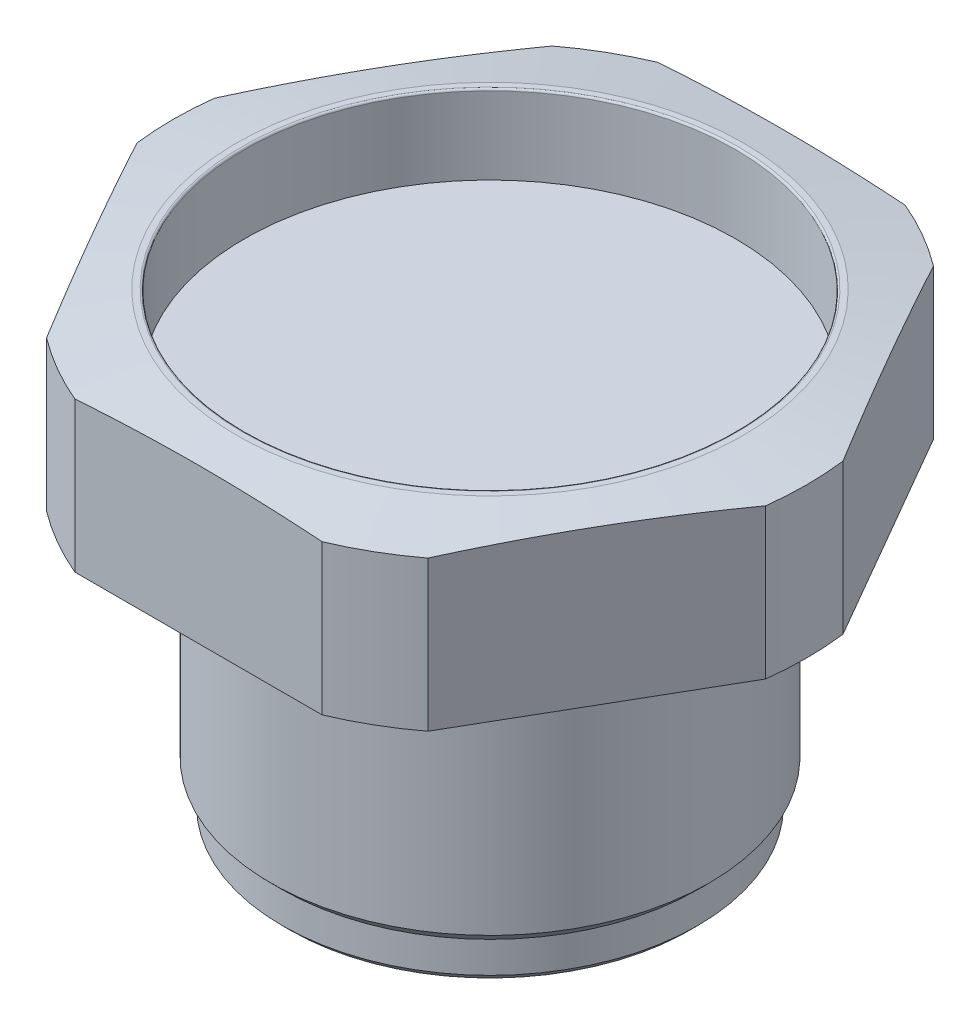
ISO-10303-21;
HEADER;
FILE_DESCRIPTION(('STEP AP214'),'2;1');
FILE_NAME('part.step','',(''),(''),'','','');
FILE_SCHEMA(('AUTOMOTIVE_DESIGN { 1 0 10303 214 1 1 1 1 }'));
ENDSEC;
DATA;
#1=APPLICATION_CONTEXT('core data for automotive mechanical design processes');
#2=APPLICATION_PROTOCOL_DEFINITION('international standard','automotive_design',2000,#1);
#3=PRODUCT_CONTEXT('',#1,'mechanical');
#4=PRODUCT('Part','Part','',(#3));
#5=PRODUCT_RELATED_PRODUCT_CATEGORY('part','',(#4));
#6=PRODUCT_DEFINITION_FORMATION('','',#4);
#7=PRODUCT_DEFINITION_CONTEXT('part definition',#1,'design');
#8=PRODUCT_DEFINITION('design','',#6,#7);
#9=PRODUCT_DEFINITION_SHAPE('','',#8);
#10=(LENGTH_UNIT() NAMED_UNIT(*) SI_UNIT(.MILLI.,.METRE.));
#11=(NAMED_UNIT(*) PLANE_ANGLE_UNIT() SI_UNIT($,.RADIAN.));
#12=(NAMED_UNIT(*) SI_UNIT($,.STERADIAN.) SOLID_ANGLE_UNIT());
#13=UNCERTAINTY_MEASURE_WITH_UNIT(LENGTH_MEASURE(1.E-05),#10,'distance_accuracy_value','');
#14=(GEOMETRIC_REPRESENTATION_CONTEXT(3) GLOBAL_UNCERTAINTY_ASSIGNED_CONTEXT((#13)) GLOBAL_UNIT_ASSIGNED_CONTEXT((#10,
#11,#12)) REPRESENTATION_CONTEXT('',''));
#15=CARTESIAN_POINT('',(0.,0.,0.));
#16=DIRECTION('',(0.,0.,1.));
#17=DIRECTION('',(1.,0.,0.));
#18=AXIS2_PLACEMENT_3D('',#15,#16,#17);
#19=CARTESIAN_POINT('',(27.0499967,-38.354,0.));
#20=DIRECTION('',(0.,-1.,0.));
#21=DIRECTION('',(0.,0.,-1.));
#22=AXIS2_PLACEMENT_3D('',#19,#20,#21);
#23=PLANE('',#22);
#24=CARTESIAN_POINT('',(0.,-38.354,0.));
#25=DIRECTION('',(0.,-1.,0.));
#26=DIRECTION('',(0.,0.,-1.));
#27=AXIS2_PLACEMENT_3D('',#24,#25,#26);
#28=CIRCLE('',#27,23.7209044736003);
#29=CARTESIAN_POINT('',(0.,-38.354,-23.7209044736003));
#30=VERTEX_POINT('',#29);
#31=EDGE_CURVE('E197',#30,#30,#28,.T.);
#32=ORIENTED_EDGE('',*,*,#31,.F.);
#33=EDGE_LOOP('',(#32));
#34=FACE_BOUND('',#33,.T.);
#35=CARTESIAN_POINT('',(0.,-38.354,0.));
#36=DIRECTION('',(0.,-1.,0.));
#37=DIRECTION('',(0.,0.,-1.));
#38=AXIS2_PLACEMENT_3D('',#35,#36,#37);
#39=CIRCLE('',#38,26.0339967);
#40=CARTESIAN_POINT('',(0.,-38.354,-26.0339967));
#41=VERTEX_POINT('',#40);
#42=EDGE_CURVE('E179',#41,#41,#39,.T.);
#43=ORIENTED_EDGE('',*,*,#42,.T.);
#44=EDGE_LOOP('',(#43));
#45=FACE_BOUND('',#44,.T.);
#46=ADVANCED_FACE('F35',(#34,#45),#23,.T.);
#47=CARTESIAN_POINT('',(0.,-8.96894233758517,0.));
#48=DIRECTION('',(0.,-1.,0.));
#49=DIRECTION('',(0.,0.,-1.));
#50=AXIS2_PLACEMENT_3D('',#47,#48,#49);
#51=CYLINDRICAL_SURFACE('',#50,27.0499967);
#52=CARTESIAN_POINT('',(0.,-0.508000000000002,0.));
#53=DIRECTION('',(0.,-1.,0.));
#54=DIRECTION('',(0.,0.,-1.));
#55=AXIS2_PLACEMENT_3D('',#52,#53,#54);
#56=CIRCLE('',#55,27.0499967);
#57=CARTESIAN_POINT('',(0.,-0.508000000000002,-27.0499967));
#58=VERTEX_POINT('',#57);
#59=EDGE_CURVE('E191',#58,#58,#56,.T.);
#60=ORIENTED_EDGE('',*,*,#59,.T.);
#61=EDGE_LOOP('',(#60));
#62=FACE_BOUND('',#61,.T.);
#63=CARTESIAN_POINT('',(0.,-5.08,0.));
#64=DIRECTION('',(0.,-1.,0.));
#65=DIRECTION('',(1.,0.,0.));
#66=AXIS2_PLACEMENT_3D('',#63,#64,#65);
#67=CIRCLE('',#66,27.0499967);
#68=CARTESIAN_POINT('',(27.0499967,-5.08,0.));
#69=VERTEX_POINT('',#68);
#70=EDGE_CURVE('E188',#69,#69,#67,.T.);
#71=ORIENTED_EDGE('',*,*,#70,.F.);
#72=EDGE_LOOP('',(#71));
#73=FACE_BOUND('',#72,.T.);
#74=ADVANCED_FACE('F218',(#62,#73),#51,.T.);
#75=CARTESIAN_POINT('',(0.,19.5502207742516,0.));
#76=DIRECTION('',(0.,-1.,0.));
#77=DIRECTION('',(0.,0.,-1.));
#78=AXIS2_PLACEMENT_3D('',#75,#76,#77);
#79=CONICAL_SURFACE('',#78,41.275,1.39626340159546);
#80=CARTESIAN_POINT('',(0.,21.0058,0.));
#81=DIRECTION('',(0.,-1.,0.));
#82=DIRECTION('',(0.,0.,-1.));
#83=AXIS2_PLACEMENT_3D('',#80,#81,#82);
#84=CIRCLE('',#83,33.02);
#85=CARTESIAN_POINT('',(0.,21.0058,-33.02));
#86=VERTEX_POINT('',#85);
#87=EDGE_CURVE('E393',#86,#86,#84,.T.);
#88=ORIENTED_EDGE('',*,*,#87,.T.);
#89=EDGE_LOOP('',(#88));
#90=FACE_BOUND('',#89,.T.);
#91=CARTESIAN_POINT('',(0.,19.5502207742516,0.));
#92=DIRECTION('',(0.,-1.,0.));
#93=DIRECTION('',(0.,0.,-1.));
#94=AXIS2_PLACEMENT_3D('',#91,#92,#93);
#95=CIRCLE('',#94,41.275);
#96=CARTESIAN_POINT('',(-40.9659173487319,19.5502207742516,5.04174977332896));
#97=VERTEX_POINT('',#96);
#98=CARTESIAN_POINT('',(-40.9659173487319,19.5502207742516,-5.04174977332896));
#99=VERTEX_POINT('',#98);
#100=EDGE_CURVE('E139',#97,#99,#95,.T.);
#101=ORIENTED_EDGE('',*,*,#100,.F.);
#102=CARTESIAN_POINT('',(-40.9673696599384,19.5500207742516,5.0392342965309));
#103=CARTESIAN_POINT('',(-40.6318536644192,19.5962299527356,5.62036504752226));
#104=CARTESIAN_POINT('',(-40.2962544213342,19.640002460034,6.20163998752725));
#105=CARTESIAN_POINT('',(-39.6248953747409,19.7223985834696,7.36446796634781));
#106=CARTESIAN_POINT('',(-39.2891355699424,19.7610221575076,7.94602100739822));
#107=CARTESIAN_POINT('',(-38.2816022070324,19.8687583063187,9.691119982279));
#108=CARTESIAN_POINT('',(-37.609604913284,19.9297320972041,10.8550534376));
#109=CARTESIAN_POINT('',(-36.2660437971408,20.0280404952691,13.182169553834));
#110=CARTESIAN_POINT('',(-35.5944805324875,20.0654054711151,14.3453512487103));
#111=CARTESIAN_POINT('',(-34.251138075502,20.1153717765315,16.6720886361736));
#112=CARTESIAN_POINT('',(-33.5793588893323,20.127973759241,17.8356443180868));
#113=CARTESIAN_POINT('',(-32.2358005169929,20.127973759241,20.1627556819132));
#114=CARTESIAN_POINT('',(-31.5640213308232,20.1153717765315,21.3263113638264));
#115=CARTESIAN_POINT('',(-30.2206788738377,20.0654054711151,23.6530487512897));
#116=CARTESIAN_POINT('',(-29.5491156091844,20.0280404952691,24.816230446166));
#117=CARTESIAN_POINT('',(-28.2055544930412,19.9297320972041,27.1433465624));
#118=CARTESIAN_POINT('',(-27.5335571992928,19.8687583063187,28.307280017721));
#119=CARTESIAN_POINT('',(-26.5260238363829,19.7610221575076,30.0523789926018));
#120=CARTESIAN_POINT('',(-26.1902640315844,19.7223985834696,30.6339320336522));
#121=CARTESIAN_POINT('',(-25.5189049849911,19.640002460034,31.7967600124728));
#122=CARTESIAN_POINT('',(-25.183305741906,19.5962299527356,32.3780349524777));
#123=CARTESIAN_POINT('',(-24.8477897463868,19.5500207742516,32.9591657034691));
#124=B_SPLINE_CURVE_WITH_KNOTS('',3,(#102,#103,#104,#105,#106,#107,#108,#109,#110,#111,#112,
#113,#114,#115,#116,#117,#118,#119,#120,#121,#122,#123),.UNSPECIFIED.,.F.,.F.,(4,2,2,2,2,2,2,2,
2,2,4),(0.,2.01785524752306,4.03572699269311,8.07165217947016,12.1023752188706,16.132991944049,
20.1636086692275,24.1943317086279,28.230256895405,30.248128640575,32.2659838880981),.UNSPECIFIED.);
#125=CARTESIAN_POINT('',(-24.8492420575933,19.5502207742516,32.956650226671));
#126=VERTEX_POINT('',#125);
#127=EDGE_CURVE('E392',#97,#126,#124,.T.);
#128=ORIENTED_EDGE('',*,*,#127,.T.);
#129=CARTESIAN_POINT('',(-16.1166752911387,19.5502207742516,37.9984));
#130=VERTEX_POINT('',#129);
#131=EDGE_CURVE('E384',#130,#126,#95,.T.);
#132=ORIENTED_EDGE('',*,*,#131,.F.);
#133=CARTESIAN_POINT('',(-57.8639051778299,14.6218698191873,37.9984));
#134=CARTESIAN_POINT('',(-57.0019930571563,14.7489031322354,37.9984));
#135=CARTESIAN_POINT('',(-56.139958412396,14.8751046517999,37.9984));
#136=CARTESIAN_POINT('',(-54.4156199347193,15.125664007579,37.9984));
#137=CARTESIAN_POINT('',(-53.5533161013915,15.2500218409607,37.9984));
#138=CARTESIAN_POINT('',(-50.9659374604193,15.6200635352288,37.9984));
#139=CARTESIAN_POINT('',(-49.2404266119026,15.8627109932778,37.9984));
#140=CARTESIAN_POINT('',(-45.7873021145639,16.3382293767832,37.9984));
#141=CARTESIAN_POINT('',(-44.0596878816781,16.5710960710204,37.9984));
#142=CARTESIAN_POINT('',(-40.6028670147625,17.0246892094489,37.9984));
#143=CARTESIAN_POINT('',(-38.8736603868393,17.245415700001,37.9984));
#144=CARTESIAN_POINT('',(-35.419217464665,17.6711956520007,37.9984));
#145=CARTESIAN_POINT('',(-33.6939873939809,17.8762993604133,37.9984));
#146=CARTESIAN_POINT('',(-30.2414345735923,18.2682133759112,37.9984));
#147=CARTESIAN_POINT('',(-28.5141118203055,18.4550236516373,37.9984));
#148=CARTESIAN_POINT('',(-25.0572784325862,18.8062070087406,37.9984));
#149=CARTESIAN_POINT('',(-23.3277679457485,18.9705815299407,37.9984));
#150=CARTESIAN_POINT('',(-19.8663595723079,19.2721663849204,37.9984));
#151=CARTESIAN_POINT('',(-18.1344616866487,19.4093767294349,37.9984));
#152=CARTESIAN_POINT('',(-14.6602163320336,19.6521327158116,37.9984));
#153=CARTESIAN_POINT('',(-12.9178580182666,19.7575264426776,37.9984));
#154=CARTESIAN_POINT('',(-10.3029433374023,19.8876204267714,37.9984));
#155=CARTESIAN_POINT('',(-9.43107075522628,19.9263191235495,37.9984));
#156=CARTESIAN_POINT('',(-7.68694739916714,19.9938955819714,37.9984));
#157=CARTESIAN_POINT('',(-6.81469662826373,20.0227734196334,37.9984));
#158=CARTESIAN_POINT('',(-5.0700654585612,20.0703033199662,37.9984));
#159=CARTESIAN_POINT('',(-4.19768510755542,20.0889571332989,37.9984));
#160=CARTESIAN_POINT('',(-2.45276864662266,20.1157789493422,37.9984));
#161=CARTESIAN_POINT('',(-1.58023253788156,20.1239470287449,37.9984));
#162=CARTESIAN_POINT('',(0.164877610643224,20.1296767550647,37.9984));
#163=CARTESIAN_POINT('',(1.03745165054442,20.1272383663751,37.9984));
#164=CARTESIAN_POINT('',(2.78250560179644,20.1117916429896,37.9984));
#165=CARTESIAN_POINT('',(3.65498551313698,20.0987833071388,37.9984));
#166=CARTESIAN_POINT('',(5.40109406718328,20.0623572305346,37.9984));
#167=CARTESIAN_POINT('',(6.27472237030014,20.0389232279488,37.9984));
#168=CARTESIAN_POINT('',(8.0216525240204,19.9819781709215,37.9984));
#169=CARTESIAN_POINT('',(8.89495437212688,19.9484670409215,37.9984));
#170=CARTESIAN_POINT('',(11.5142177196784,19.833470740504,37.9984));
#171=CARTESIAN_POINT('',(13.2595585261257,19.7375221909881,37.9984));
#172=CARTESIAN_POINT('',(16.748434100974,19.5116068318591,37.9984));
#173=CARTESIAN_POINT('',(18.4919682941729,19.3816313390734,37.9984));
#174=CARTESIAN_POINT('',(21.9766261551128,19.0928384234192,37.9984));
#175=CARTESIAN_POINT('',(23.7177498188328,18.9340209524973,37.9984));
#176=CARTESIAN_POINT('',(27.1033127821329,18.6017526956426,37.9984));
#177=CARTESIAN_POINT('',(28.7478770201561,18.4295617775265,37.9984));
#178=CARTESIAN_POINT('',(32.0350715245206,18.0675285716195,37.9984));
#179=CARTESIAN_POINT('',(33.6777017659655,17.8776860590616,37.9984));
#180=CARTESIAN_POINT('',(36.9612926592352,17.4835029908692,37.9984));
#181=CARTESIAN_POINT('',(38.6022532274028,17.279161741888,37.9984));
#182=CARTESIAN_POINT('',(41.8826385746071,16.8585980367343,37.9984));
#183=CARTESIAN_POINT('',(43.5220633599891,16.6423756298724,37.9984));
#184=CARTESIAN_POINT('',(46.7998380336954,16.2001333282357,37.9984));
#185=CARTESIAN_POINT('',(48.4381877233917,15.974111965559,37.9984));
#186=CARTESIAN_POINT('',(51.7137535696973,15.5140087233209,37.9984));
#187=CARTESIAN_POINT('',(53.3509697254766,15.2799268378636,37.9984));
#188=CARTESIAN_POINT('',(56.624382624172,14.805081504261,37.9984));
#189=CARTESIAN_POINT('',(58.2605793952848,14.5643182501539,37.9984));
#190=CARTESIAN_POINT('',(61.5321396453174,14.0772070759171,37.9984));
#191=CARTESIAN_POINT('',(63.1675031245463,13.8308591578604,37.9984));
#192=CARTESIAN_POINT('',(66.430533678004,13.3345330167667,37.9984));
#193=CARTESIAN_POINT('',(68.0582037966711,13.0845747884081,37.9984));
#194=CARTESIAN_POINT('',(71.3129338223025,12.5807143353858,37.9984));
#195=CARTESIAN_POINT('',(72.9399937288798,12.3268121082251,37.9984));
#196=CARTESIAN_POINT('',(77.8204109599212,11.5600905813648,37.9984));
#197=CARTESIAN_POINT('',(81.07298140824,11.0422601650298,37.9984));
#198=CARTESIAN_POINT('',(85.9496272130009,10.2582808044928,37.9984));
#199=CARTESIAN_POINT('',(87.5742999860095,9.99583189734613,37.9984));
#200=CARTESIAN_POINT('',(90.8232964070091,9.46877892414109,37.9984));
#201=CARTESIAN_POINT('',(92.4476200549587,9.20417485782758,37.9984));
#202=CARTESIAN_POINT('',(95.6959355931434,8.67309809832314,37.9984));
#203=CARTESIAN_POINT('',(97.3199274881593,8.40662543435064,37.9984));
#204=CARTESIAN_POINT('',(100.567638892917,7.87203038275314,37.9984));
#205=CARTESIAN_POINT('',(102.191358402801,7.60390799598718,37.9984));
#206=CARTESIAN_POINT('',(103.814959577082,7.33507210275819,37.9984));
#207=B_SPLINE_CURVE_WITH_KNOTS('',3,(#133,#134,#135,#136,#137,#138,#139,#140,#141,#142,#143,
#144,#145,#146,#147,#148,#149,#150,#151,#152,#153,#154,#155,#156,#157,#158,#159,#160,#161,#162,
#163,#164,#165,#166,#167,#168,#169,#170,#171,#172,#173,#174,#175,#176,#177,#178,#179,#180,#181,
#182,#183,#184,#185,#186,#187,#188,#189,#190,#191,#192,#193,#194,#195,#196,#197,#198,#199,#200,
#201,#202,#203,#204,#205,#206),.UNSPECIFIED.,.F.,.F.,(4,2,2,2,2,2,2,2,2,2,2,2,2,2,2,2,2,2,2,2,2,
2,2,2,2,2,2,2,2,2,2,2,2,2,2,2,4),(0.,2.6136690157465,5.22734204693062,10.454782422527,
15.6844614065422,20.9141204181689,26.1261792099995,31.3382469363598,36.549980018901,
41.7617110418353,46.9979466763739,49.6160934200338,52.2342198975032,54.8518979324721,
57.4695568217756,60.0872244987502,62.7048924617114,65.3266578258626,67.9484428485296,
73.1919483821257,78.4367932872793,83.681646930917,88.6421976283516,93.602811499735,
98.5636627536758,103.524493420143,108.486069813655,113.447649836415,118.409085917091,
123.37052015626,128.310767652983,133.251018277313,143.131593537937,148.068795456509,
153.005997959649,157.943123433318,162.880246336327),.UNSPECIFIED.);
#208=CARTESIAN_POINT('',(16.1166752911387,19.5502207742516,37.9984));
#209=VERTEX_POINT('',#208);
#210=EDGE_CURVE('E287',#130,#209,#207,.T.);
#211=ORIENTED_EDGE('',*,*,#210,.T.);
#212=CARTESIAN_POINT('',(24.8492420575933,19.5502207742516,32.956650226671));
#213=VERTEX_POINT('',#212);
#214=EDGE_CURVE('E356',#213,#209,#95,.T.);
#215=ORIENTED_EDGE('',*,*,#214,.F.);
#216=CARTESIAN_POINT('',(24.8477897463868,19.5500207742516,32.9591657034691));
#217=CARTESIAN_POINT('',(25.183305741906,19.5962299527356,32.3780349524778));
#218=CARTESIAN_POINT('',(25.5189049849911,19.640002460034,31.7967600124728));
#219=CARTESIAN_POINT('',(26.1902640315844,19.7223985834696,30.6339320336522));
#220=CARTESIAN_POINT('',(26.5260238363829,19.7610221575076,30.0523789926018));
#221=CARTESIAN_POINT('',(27.5335571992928,19.8687583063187,28.307280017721));
#222=CARTESIAN_POINT('',(28.2055544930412,19.9297320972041,27.1433465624));
#223=CARTESIAN_POINT('',(29.5491156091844,20.0280404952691,24.8162304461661));
#224=CARTESIAN_POINT('',(30.2206788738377,20.0654054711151,23.6530487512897));
#225=CARTESIAN_POINT('',(31.5640213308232,20.1153717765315,21.3263113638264));
#226=CARTESIAN_POINT('',(32.2358005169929,20.127973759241,20.1627556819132));
#227=CARTESIAN_POINT('',(33.5793588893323,20.127973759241,17.8356443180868));
#228=CARTESIAN_POINT('',(34.251138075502,20.1153717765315,16.6720886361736));
#229=CARTESIAN_POINT('',(35.5944805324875,20.0654054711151,14.3453512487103));
#230=CARTESIAN_POINT('',(36.2660437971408,20.0280404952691,13.182169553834));
#231=CARTESIAN_POINT('',(37.609604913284,19.9297320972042,10.8550534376));
#232=CARTESIAN_POINT('',(38.2816022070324,19.8687583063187,9.69111998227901));
#233=CARTESIAN_POINT('',(39.2891355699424,19.7610221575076,7.94602100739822));
#234=CARTESIAN_POINT('',(39.6248953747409,19.7223985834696,7.36446796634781));
#235=CARTESIAN_POINT('',(40.2962544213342,19.640002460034,6.20163998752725));
#236=CARTESIAN_POINT('',(40.6318536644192,19.5962299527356,5.62036504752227));
#237=CARTESIAN_POINT('',(40.9673696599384,19.5500207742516,5.0392342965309));
#238=B_SPLINE_CURVE_WITH_KNOTS('',3,(#216,#217,#218,#219,#220,#221,#222,#223,#224,#225,#226,
#227,#228,#229,#230,#231,#232,#233,#234,#235,#236,#237),.UNSPECIFIED.,.F.,.F.,(4,2,2,2,2,2,2,2,
2,2,4),(0.,2.01785524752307,4.03572699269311,8.07165217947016,12.1023752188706,16.132991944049,
20.1636086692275,24.1943317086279,28.230256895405,30.248128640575,32.2659838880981),.UNSPECIFIED.);
#239=CARTESIAN_POINT('',(40.9659173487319,19.5502207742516,5.04174977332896));
#240=VERTEX_POINT('',#239);
#241=EDGE_CURVE('E339',#213,#240,#238,.T.);
#242=ORIENTED_EDGE('',*,*,#241,.T.);
#243=CARTESIAN_POINT('',(40.9659173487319,19.5502207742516,-5.04174977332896));
#244=VERTEX_POINT('',#243);
#245=EDGE_CURVE('E162',#244,#240,#95,.T.);
#246=ORIENTED_EDGE('',*,*,#245,.F.);
#247=CARTESIAN_POINT('',(40.9673696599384,19.5500207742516,-5.0392342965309));
#248=CARTESIAN_POINT('',(40.6318536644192,19.5962299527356,-5.62036504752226));
#249=CARTESIAN_POINT('',(40.2962544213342,19.640002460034,-6.20163998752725));
#250=CARTESIAN_POINT('',(39.6248953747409,19.7223985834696,-7.36446796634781));
#251=CARTESIAN_POINT('',(39.2891355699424,19.7610221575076,-7.94602100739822));
#252=CARTESIAN_POINT('',(38.2816022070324,19.8687583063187,-9.691119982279));
#253=CARTESIAN_POINT('',(37.609604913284,19.9297320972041,-10.8550534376));
#254=CARTESIAN_POINT('',(36.2660437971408,20.0280404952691,-13.182169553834));
#255=CARTESIAN_POINT('',(35.5944805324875,20.0654054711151,-14.3453512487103));
#256=CARTESIAN_POINT('',(34.251138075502,20.1153717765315,-16.6720886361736));
#257=CARTESIAN_POINT('',(33.5793588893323,20.127973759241,-17.8356443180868));
#258=CARTESIAN_POINT('',(32.2358005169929,20.127973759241,-20.1627556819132));
#259=CARTESIAN_POINT('',(31.5640213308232,20.1153717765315,-21.3263113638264));
#260=CARTESIAN_POINT('',(30.2206788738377,20.0654054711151,-23.6530487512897));
#261=CARTESIAN_POINT('',(29.5491156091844,20.0280404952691,-24.816230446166));
#262=CARTESIAN_POINT('',(28.2055544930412,19.9297320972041,-27.1433465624));
#263=CARTESIAN_POINT('',(27.5335571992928,19.8687583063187,-28.307280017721));
#264=CARTESIAN_POINT('',(26.5260238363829,19.7610221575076,-30.0523789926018));
#265=CARTESIAN_POINT('',(26.1902640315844,19.7223985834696,-30.6339320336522));
#266=CARTESIAN_POINT('',(25.5189049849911,19.640002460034,-31.7967600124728));
#267=CARTESIAN_POINT('',(25.183305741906,19.5962299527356,-32.3780349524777));
#268=CARTESIAN_POINT('',(24.8477897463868,19.5500207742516,-32.9591657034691));
#269=B_SPLINE_CURVE_WITH_KNOTS('',3,(#247,#248,#249,#250,#251,#252,#253,#254,#255,#256,#257,
#258,#259,#260,#261,#262,#263,#264,#265,#266,#267,#268),.UNSPECIFIED.,.F.,.F.,(4,2,2,2,2,2,2,2,
2,2,4),(0.,2.01785524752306,4.03572699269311,8.07165217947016,12.1023752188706,16.132991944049,
20.1636086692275,24.1943317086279,28.230256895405,30.248128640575,32.2659838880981),.UNSPECIFIED.);
#270=CARTESIAN_POINT('',(24.8492420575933,19.5502207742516,-32.956650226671));
#271=VERTEX_POINT('',#270);
#272=EDGE_CURVE('E331',#244,#271,#269,.T.);
#273=ORIENTED_EDGE('',*,*,#272,.T.);
#274=CARTESIAN_POINT('',(16.1166752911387,19.5502207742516,-37.9984));
#275=VERTEX_POINT('',#274);
#276=EDGE_CURVE('E158',#275,#271,#95,.T.);
#277=ORIENTED_EDGE('',*,*,#276,.F.);
#278=CARTESIAN_POINT('',(-57.8639051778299,14.6218698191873,-37.9984));
#279=CARTESIAN_POINT('',(-57.0019930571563,14.7489031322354,-37.9984));
#280=CARTESIAN_POINT('',(-56.139958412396,14.8751046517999,-37.9984));
#281=CARTESIAN_POINT('',(-54.4156199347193,15.125664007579,-37.9984));
#282=CARTESIAN_POINT('',(-53.5533161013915,15.2500218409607,-37.9984));
#283=CARTESIAN_POINT('',(-50.9659374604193,15.6200635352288,-37.9984));
#284=CARTESIAN_POINT('',(-49.2404266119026,15.8627109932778,-37.9984));
#285=CARTESIAN_POINT('',(-45.7873021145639,16.3382293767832,-37.9984));
#286=CARTESIAN_POINT('',(-44.0596878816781,16.5710960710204,-37.9984));
#287=CARTESIAN_POINT('',(-40.6028670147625,17.0246892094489,-37.9984));
#288=CARTESIAN_POINT('',(-38.8736603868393,17.245415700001,-37.9984));
#289=CARTESIAN_POINT('',(-35.419217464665,17.6711956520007,-37.9984));
#290=CARTESIAN_POINT('',(-33.6939873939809,17.8762993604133,-37.9984));
#291=CARTESIAN_POINT('',(-30.2414345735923,18.2682133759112,-37.9984));
#292=CARTESIAN_POINT('',(-28.5141118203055,18.4550236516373,-37.9984));
#293=CARTESIAN_POINT('',(-25.0572784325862,18.8062070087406,-37.9984));
#294=CARTESIAN_POINT('',(-23.3277679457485,18.9705815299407,-37.9984));
#295=CARTESIAN_POINT('',(-19.8663595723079,19.2721663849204,-37.9984));
#296=CARTESIAN_POINT('',(-18.1344616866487,19.4093767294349,-37.9984));
#297=CARTESIAN_POINT('',(-14.6602163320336,19.6521327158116,-37.9984));
#298=CARTESIAN_POINT('',(-12.9178580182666,19.7575264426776,-37.9984));
#299=CARTESIAN_POINT('',(-10.3029433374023,19.8876204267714,-37.9984));
#300=CARTESIAN_POINT('',(-9.43107075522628,19.9263191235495,-37.9984));
#301=CARTESIAN_POINT('',(-7.68694739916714,19.9938955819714,-37.9984));
#302=CARTESIAN_POINT('',(-6.81469662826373,20.0227734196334,-37.9984));
#303=CARTESIAN_POINT('',(-5.0700654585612,20.0703033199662,-37.9984));
#304=CARTESIAN_POINT('',(-4.19768510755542,20.0889571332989,-37.9984));
#305=CARTESIAN_POINT('',(-2.45276864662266,20.1157789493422,-37.9984));
#306=CARTESIAN_POINT('',(-1.58023253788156,20.1239470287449,-37.9984));
#307=CARTESIAN_POINT('',(0.164877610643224,20.1296767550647,-37.9984));
#308=CARTESIAN_POINT('',(1.03745165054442,20.1272383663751,-37.9984));
#309=CARTESIAN_POINT('',(2.78250560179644,20.1117916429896,-37.9984));
#310=CARTESIAN_POINT('',(3.65498551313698,20.0987833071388,-37.9984));
#311=CARTESIAN_POINT('',(5.40109406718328,20.0623572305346,-37.9984));
#312=CARTESIAN_POINT('',(6.27472237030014,20.0389232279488,-37.9984));
#313=CARTESIAN_POINT('',(8.0216525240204,19.9819781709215,-37.9984));
#314=CARTESIAN_POINT('',(8.89495437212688,19.9484670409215,-37.9984));
#315=CARTESIAN_POINT('',(11.5142177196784,19.833470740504,-37.9984));
#316=CARTESIAN_POINT('',(13.2595585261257,19.7375221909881,-37.9984));
#317=CARTESIAN_POINT('',(16.748434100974,19.5116068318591,-37.9984));
#318=CARTESIAN_POINT('',(18.4919682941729,19.3816313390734,-37.9984));
#319=CARTESIAN_POINT('',(21.9766261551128,19.0928384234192,-37.9984));
#320=CARTESIAN_POINT('',(23.7177498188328,18.9340209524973,-37.9984));
#321=CARTESIAN_POINT('',(27.1033127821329,18.6017526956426,-37.9984));
#322=CARTESIAN_POINT('',(28.7478770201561,18.4295617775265,-37.9984));
#323=CARTESIAN_POINT('',(32.0350715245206,18.0675285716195,-37.9984));
#324=CARTESIAN_POINT('',(33.6777017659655,17.8776860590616,-37.9984));
#325=CARTESIAN_POINT('',(36.9612926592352,17.4835029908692,-37.9984));
#326=CARTESIAN_POINT('',(38.6022532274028,17.279161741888,-37.9984));
#327=CARTESIAN_POINT('',(41.8826385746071,16.8585980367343,-37.9984));
#328=CARTESIAN_POINT('',(43.5220633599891,16.6423756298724,-37.9984));
#329=CARTESIAN_POINT('',(46.7998380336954,16.2001333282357,-37.9984));
#330=CARTESIAN_POINT('',(48.4381877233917,15.974111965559,-37.9984));
#331=CARTESIAN_POINT('',(51.7137535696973,15.5140087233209,-37.9984));
#332=CARTESIAN_POINT('',(53.3509697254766,15.2799268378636,-37.9984));
#333=CARTESIAN_POINT('',(56.624382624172,14.805081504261,-37.9984));
#334=CARTESIAN_POINT('',(58.2605793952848,14.5643182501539,-37.9984));
#335=CARTESIAN_POINT('',(61.5321396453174,14.0772070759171,-37.9984));
#336=CARTESIAN_POINT('',(63.1675031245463,13.8308591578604,-37.9984));
#337=CARTESIAN_POINT('',(66.430533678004,13.3345330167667,-37.9984));
#338=CARTESIAN_POINT('',(68.0582037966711,13.0845747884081,-37.9984));
#339=CARTESIAN_POINT('',(71.3129338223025,12.5807143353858,-37.9984));
#340=CARTESIAN_POINT('',(72.9399937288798,12.3268121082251,-37.9984));
#341=CARTESIAN_POINT('',(77.8204109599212,11.5600905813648,-37.9984));
#342=CARTESIAN_POINT('',(81.07298140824,11.0422601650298,-37.9984));
#343=CARTESIAN_POINT('',(85.9496272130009,10.2582808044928,-37.9984));
#344=CARTESIAN_POINT('',(87.5742999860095,9.99583189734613,-37.9984));
#345=CARTESIAN_POINT('',(90.8232964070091,9.46877892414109,-37.9984));
#346=CARTESIAN_POINT('',(92.4476200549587,9.20417485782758,-37.9984));
#347=CARTESIAN_POINT('',(95.6959355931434,8.67309809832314,-37.9984));
#348=CARTESIAN_POINT('',(97.3199274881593,8.40662543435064,-37.9984));
#349=CARTESIAN_POINT('',(100.567638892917,7.87203038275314,-37.9984));
#350=CARTESIAN_POINT('',(102.191358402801,7.60390799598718,-37.9984));
#351=CARTESIAN_POINT('',(103.814959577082,7.33507210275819,-37.9984));
#352=B_SPLINE_CURVE_WITH_KNOTS('',3,(#278,#279,#280,#281,#282,#283,#284,#285,#286,#287,#288,
#289,#290,#291,#292,#293,#294,#295,#296,#297,#298,#299,#300,#301,#302,#303,#304,#305,#306,#307,
#308,#309,#310,#311,#312,#313,#314,#315,#316,#317,#318,#319,#320,#321,#322,#323,#324,#325,#326,
#327,#328,#329,#330,#331,#332,#333,#334,#335,#336,#337,#338,#339,#340,#341,#342,#343,#344,#345,
#346,#347,#348,#349,#350,#351),.UNSPECIFIED.,.F.,.F.,(4,2,2,2,2,2,2,2,2,2,2,2,2,2,2,2,2,2,2,2,2,
2,2,2,2,2,2,2,2,2,2,2,2,2,2,2,4),(0.,2.6136690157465,5.22734204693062,10.454782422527,
15.6844614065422,20.9141204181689,26.1261792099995,31.3382469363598,36.549980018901,
41.7617110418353,46.9979466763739,49.6160934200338,52.2342198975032,54.8518979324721,
57.4695568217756,60.0872244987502,62.7048924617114,65.3266578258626,67.9484428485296,
73.1919483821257,78.4367932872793,83.681646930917,88.6421976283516,93.602811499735,
98.5636627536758,103.524493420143,108.486069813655,113.447649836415,118.409085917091,
123.37052015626,128.310767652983,133.251018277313,143.131593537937,148.068795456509,
153.005997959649,157.943123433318,162.880246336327),.UNSPECIFIED.);
#353=CARTESIAN_POINT('',(-16.1166752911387,19.5502207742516,-37.9984));
#354=VERTEX_POINT('',#353);
#355=EDGE_CURVE('E321',#275,#354,#352,.F.);
#356=ORIENTED_EDGE('',*,*,#355,.T.);
#357=CARTESIAN_POINT('',(-24.8492420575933,19.5502207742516,-32.956650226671));
#358=VERTEX_POINT('',#357);
#359=EDGE_CURVE('E155',#358,#354,#95,.T.);
#360=ORIENTED_EDGE('',*,*,#359,.F.);
#361=CARTESIAN_POINT('',(-24.8477897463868,19.5500207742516,-32.9591657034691));
#362=CARTESIAN_POINT('',(-25.183305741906,19.5962299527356,-32.3780349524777));
#363=CARTESIAN_POINT('',(-25.5189049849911,19.640002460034,-31.7967600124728));
#364=CARTESIAN_POINT('',(-26.1902640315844,19.7223985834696,-30.6339320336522));
#365=CARTESIAN_POINT('',(-26.5260238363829,19.7610221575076,-30.0523789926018));
#366=CARTESIAN_POINT('',(-27.5335571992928,19.8687583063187,-28.307280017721));
#367=CARTESIAN_POINT('',(-28.2055544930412,19.9297320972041,-27.1433465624));
#368=CARTESIAN_POINT('',(-29.5491156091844,20.0280404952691,-24.816230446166));
#369=CARTESIAN_POINT('',(-30.2206788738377,20.0654054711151,-23.6530487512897));
#370=CARTESIAN_POINT('',(-31.5640213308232,20.1153717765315,-21.3263113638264));
#371=CARTESIAN_POINT('',(-32.2358005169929,20.127973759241,-20.1627556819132));
#372=CARTESIAN_POINT('',(-33.5793588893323,20.127973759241,-17.8356443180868));
#373=CARTESIAN_POINT('',(-34.251138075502,20.1153717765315,-16.6720886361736));
#374=CARTESIAN_POINT('',(-35.5944805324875,20.0654054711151,-14.3453512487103));
#375=CARTESIAN_POINT('',(-36.2660437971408,20.0280404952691,-13.182169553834));
#376=CARTESIAN_POINT('',(-37.609604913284,19.9297320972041,-10.8550534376));
#377=CARTESIAN_POINT('',(-38.2816022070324,19.8687583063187,-9.69111998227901));
#378=CARTESIAN_POINT('',(-39.2891355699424,19.7610221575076,-7.94602100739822));
#379=CARTESIAN_POINT('',(-39.6248953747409,19.7223985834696,-7.36446796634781));
#380=CARTESIAN_POINT('',(-40.2962544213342,19.640002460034,-6.20163998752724));
#381=CARTESIAN_POINT('',(-40.6318536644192,19.5962299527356,-5.62036504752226));
#382=CARTESIAN_POINT('',(-40.9673696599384,19.5500207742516,-5.03923429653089));
#383=B_SPLINE_CURVE_WITH_KNOTS('',3,(#361,#362,#363,#364,#365,#366,#367,#368,#369,#370,#371,
#372,#373,#374,#375,#376,#377,#378,#379,#380,#381,#382),.UNSPECIFIED.,.F.,.F.,(4,2,2,2,2,2,2,2,
2,2,4),(0.,2.01785524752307,4.03572699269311,8.07165217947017,12.1023752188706,16.132991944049,
20.1636086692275,24.1943317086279,28.230256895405,30.248128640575,32.2659838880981),.UNSPECIFIED.);
#384=EDGE_CURVE('E140',#358,#99,#383,.T.);
#385=ORIENTED_EDGE('',*,*,#384,.T.);
#386=EDGE_LOOP('',(#101,#128,#132,#211,#215,#242,#246,#273,#277,#356,#360,#385));
#387=FACE_BOUND('',#386,.T.);
#388=ADVANCED_FACE('F225',(#90,#387),#79,.T.);
#389=CARTESIAN_POINT('',(0.,-8.96894233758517,0.));
#390=DIRECTION('',(0.,-1.,0.));
#391=DIRECTION('',(0.,0.,-1.));
#392=AXIS2_PLACEMENT_3D('',#389,#390,#391);
#393=CYLINDRICAL_SURFACE('',#392,41.275);
#394=CARTESIAN_POINT('',(0.,0.,0.));
#395=DIRECTION('',(0.,-1.,0.));
#396=DIRECTION('',(0.,0.,-1.));
#397=AXIS2_PLACEMENT_3D('',#394,#395,#396);
#398=CIRCLE('',#397,41.275);
#399=CARTESIAN_POINT('',(-40.9659173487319,0.,5.04174977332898));
#400=VERTEX_POINT('',#399);
#401=CARTESIAN_POINT('',(-40.9659173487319,0.,-5.04174977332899));
#402=VERTEX_POINT('',#401);
#403=EDGE_CURVE('E137',#400,#402,#398,.T.);
#404=ORIENTED_EDGE('',*,*,#403,.F.);
#405=DIRECTION('',(0.,-1.,0.));
#406=VECTOR('',#405,1.);
#407=CARTESIAN_POINT('',(-40.9659173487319,-8.96894233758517,5.04174977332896));
#408=LINE('',#407,#406);
#409=EDGE_CURVE('E58',#400,#97,#408,.F.);
#410=ORIENTED_EDGE('',*,*,#409,.T.);
#411=ORIENTED_EDGE('',*,*,#100,.T.);
#412=DIRECTION('',(0.,-1.,0.));
#413=VECTOR('',#412,1.);
#414=CARTESIAN_POINT('',(-40.9659173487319,-8.96894233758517,-5.04174977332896));
#415=LINE('',#414,#413);
#416=EDGE_CURVE('E124',#99,#402,#415,.T.);
#417=ORIENTED_EDGE('',*,*,#416,.T.);
#418=EDGE_LOOP('',(#404,#410,#411,#417));
#419=FACE_BOUND('',#418,.T.);
#420=ADVANCED_FACE('F136',(#419),#393,.T.);
#421=ORIENTED_EDGE('',*,*,#131,.T.);
#422=DIRECTION('',(0.,-1.,0.));
#423=VECTOR('',#422,1.);
#424=CARTESIAN_POINT('',(-24.8492420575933,-8.96894233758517,32.956650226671));
#425=LINE('',#424,#423);
#426=CARTESIAN_POINT('',(-24.8492420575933,0.,32.956650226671));
#427=VERTEX_POINT('',#426);
#428=EDGE_CURVE('E391',#126,#427,#425,.T.);
#429=ORIENTED_EDGE('',*,*,#428,.T.);
#430=CARTESIAN_POINT('',(-16.1166752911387,0.,37.9984));
#431=VERTEX_POINT('',#430);
#432=EDGE_CURVE('E146',#431,#427,#398,.T.);
#433=ORIENTED_EDGE('',*,*,#432,.F.);
#434=DIRECTION('',(0.,-1.,0.));
#435=VECTOR('',#434,1.);
#436=CARTESIAN_POINT('',(-16.1166752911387,-8.96894233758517,37.9984));
#437=LINE('',#436,#435);
#438=EDGE_CURVE('E296',#431,#130,#437,.F.);
#439=ORIENTED_EDGE('',*,*,#438,.T.);
#440=EDGE_LOOP('',(#421,#429,#433,#439));
#441=FACE_BOUND('',#440,.T.);
#442=ADVANCED_FACE('F390',(#441),#393,.T.);
#443=ORIENTED_EDGE('',*,*,#214,.T.);
#444=DIRECTION('',(0.,-1.,0.));
#445=VECTOR('',#444,1.);
#446=CARTESIAN_POINT('',(16.1166752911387,-8.96894233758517,37.9984));
#447=LINE('',#446,#445);
#448=CARTESIAN_POINT('',(16.1166752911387,0.,37.9984));
#449=VERTEX_POINT('',#448);
#450=EDGE_CURVE('E297',#209,#449,#447,.T.);
#451=ORIENTED_EDGE('',*,*,#450,.T.);
#452=CARTESIAN_POINT('',(24.8492420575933,0.,32.956650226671));
#453=VERTEX_POINT('',#452);
#454=EDGE_CURVE('E149',#453,#449,#398,.T.);
#455=ORIENTED_EDGE('',*,*,#454,.F.);
#456=DIRECTION('',(0.,-1.,0.));
#457=VECTOR('',#456,1.);
#458=CARTESIAN_POINT('',(24.8492420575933,-8.96894233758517,32.956650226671));
#459=LINE('',#458,#457);
#460=EDGE_CURVE('E346',#453,#213,#459,.F.);
#461=ORIENTED_EDGE('',*,*,#460,.T.);
#462=EDGE_LOOP('',(#443,#451,#455,#461));
#463=FACE_BOUND('',#462,.T.);
#464=ADVANCED_FACE('F355',(#463),#393,.T.);
#465=ORIENTED_EDGE('',*,*,#245,.T.);
#466=DIRECTION('',(0.,-1.,0.));
#467=VECTOR('',#466,1.);
#468=CARTESIAN_POINT('',(40.9659173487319,-8.96894233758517,5.04174977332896));
#469=LINE('',#468,#467);
#470=CARTESIAN_POINT('',(40.9659173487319,0.,5.04174977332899));
#471=VERTEX_POINT('',#470);
#472=EDGE_CURVE('E347',#240,#471,#469,.T.);
#473=ORIENTED_EDGE('',*,*,#472,.T.);
#474=CARTESIAN_POINT('',(40.9659173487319,0.,-5.041749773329));
#475=VERTEX_POINT('',#474);
#476=EDGE_CURVE('E156',#475,#471,#398,.T.);
#477=ORIENTED_EDGE('',*,*,#476,.F.);
#478=DIRECTION('',(0.,-1.,0.));
#479=VECTOR('',#478,1.);
#480=CARTESIAN_POINT('',(40.9659173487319,-8.96894233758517,-5.04174977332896));
#481=LINE('',#480,#479);
#482=EDGE_CURVE('E365',#475,#244,#481,.F.);
#483=ORIENTED_EDGE('',*,*,#482,.T.);
#484=EDGE_LOOP('',(#465,#473,#477,#483));
#485=FACE_BOUND('',#484,.T.);
#486=ADVANCED_FACE('F364',(#485),#393,.T.);
#487=ORIENTED_EDGE('',*,*,#276,.T.);
#488=DIRECTION('',(0.,-1.,0.));
#489=VECTOR('',#488,1.);
#490=CARTESIAN_POINT('',(24.8492420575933,-8.96894233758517,-32.956650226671));
#491=LINE('',#490,#489);
#492=CARTESIAN_POINT('',(24.8492420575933,0.,-32.956650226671));
#493=VERTEX_POINT('',#492);
#494=EDGE_CURVE('E369',#271,#493,#491,.T.);
#495=ORIENTED_EDGE('',*,*,#494,.T.);
#496=CARTESIAN_POINT('',(16.1166752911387,0.,-37.9984));
#497=VERTEX_POINT('',#496);
#498=EDGE_CURVE('E151',#497,#493,#398,.T.);
#499=ORIENTED_EDGE('',*,*,#498,.F.);
#500=DIRECTION('',(0.,-1.,0.));
#501=VECTOR('',#500,1.);
#502=CARTESIAN_POINT('',(16.1166752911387,-8.96894233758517,-37.9984));
#503=LINE('',#502,#501);
#504=EDGE_CURVE('E373',#497,#275,#503,.F.);
#505=ORIENTED_EDGE('',*,*,#504,.T.);
#506=EDGE_LOOP('',(#487,#495,#499,#505));
#507=FACE_BOUND('',#506,.T.);
#508=ADVANCED_FACE('F428',(#507),#393,.T.);
#509=ORIENTED_EDGE('',*,*,#359,.T.);
#510=DIRECTION('',(0.,-1.,0.));
#511=VECTOR('',#510,1.);
#512=CARTESIAN_POINT('',(-16.1166752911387,-8.96894233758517,-37.9984));
#513=LINE('',#512,#511);
#514=CARTESIAN_POINT('',(-16.1166752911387,0.,-37.9984));
#515=VERTEX_POINT('',#514);
#516=EDGE_CURVE('E378',#354,#515,#513,.T.);
#517=ORIENTED_EDGE('',*,*,#516,.T.);
#518=CARTESIAN_POINT('',(-24.8492420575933,0.,-32.956650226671));
#519=VERTEX_POINT('',#518);
#520=EDGE_CURVE('E147',#519,#515,#398,.T.);
#521=ORIENTED_EDGE('',*,*,#520,.F.);
#522=DIRECTION('',(0.,-1.,0.));
#523=VECTOR('',#522,1.);
#524=CARTESIAN_POINT('',(-24.8492420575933,-8.96894233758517,-32.956650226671));
#525=LINE('',#524,#523);
#526=EDGE_CURVE('E50',#519,#358,#525,.F.);
#527=ORIENTED_EDGE('',*,*,#526,.T.);
#528=EDGE_LOOP('',(#509,#517,#521,#527));
#529=FACE_BOUND('',#528,.T.);
#530=ADVANCED_FACE('F417',(#529),#393,.T.);
#531=CARTESIAN_POINT('',(41.275,0.,0.));
#532=DIRECTION('',(0.,-1.,0.));
#533=DIRECTION('',(0.,0.,-1.));
#534=AXIS2_PLACEMENT_3D('',#531,#532,#533);
#535=PLANE('',#534);
#536=CARTESIAN_POINT('',(0.,0.,0.));
#537=DIRECTION('',(0.,-1.,0.));
#538=DIRECTION('',(0.,0.,-1.));
#539=AXIS2_PLACEMENT_3D('',#536,#537,#538);
#540=CIRCLE('',#539,27.5579967);
#541=CARTESIAN_POINT('',(0.,0.,-27.5579967));
#542=VERTEX_POINT('',#541);
#543=EDGE_CURVE('E194',#542,#542,#540,.F.);
#544=ORIENTED_EDGE('',*,*,#543,.T.);
#545=EDGE_LOOP('',(#544));
#546=FACE_BOUND('',#545,.T.);
#547=ORIENTED_EDGE('',*,*,#432,.T.);
#548=DIRECTION('',(-0.5,0.,-0.866025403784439));
#549=VECTOR('',#548,1.);
#550=CARTESIAN_POINT('',(-22.5888297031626,0.,36.8717992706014));
#551=LINE('',#550,#549);
#552=EDGE_CURVE('E145',#427,#400,#551,.T.);
#553=ORIENTED_EDGE('',*,*,#552,.T.);
#554=ORIENTED_EDGE('',*,*,#403,.T.);
#555=DIRECTION('',(0.5,0.,-0.866025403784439));
#556=VECTOR('',#555,1.);
#557=CARTESIAN_POINT('',(-22.5888297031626,0.,-36.8717992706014));
#558=LINE('',#557,#556);
#559=EDGE_CURVE('E121',#402,#519,#558,.T.);
#560=ORIENTED_EDGE('',*,*,#559,.T.);
#561=ORIENTED_EDGE('',*,*,#520,.T.);
#562=DIRECTION('',(1.,0.,0.));
#563=VECTOR('',#562,1.);
#564=CARTESIAN_POINT('',(41.275,0.,-37.9984));
#565=LINE('',#564,#563);
#566=EDGE_CURVE('E130',#515,#497,#565,.T.);
#567=ORIENTED_EDGE('',*,*,#566,.T.);
#568=ORIENTED_EDGE('',*,*,#498,.T.);
#569=DIRECTION('',(0.5,0.,0.866025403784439));
#570=VECTOR('',#569,1.);
#571=CARTESIAN_POINT('',(43.2263297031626,0.,-1.12660072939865));
#572=LINE('',#571,#570);
#573=EDGE_CURVE('E169',#493,#475,#572,.T.);
#574=ORIENTED_EDGE('',*,*,#573,.T.);
#575=ORIENTED_EDGE('',*,*,#476,.T.);
#576=DIRECTION('',(-0.5,0.,0.866025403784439));
#577=VECTOR('',#576,1.);
#578=CARTESIAN_POINT('',(43.2263297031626,0.,1.12660072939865));
#579=LINE('',#578,#577);
#580=EDGE_CURVE('E172',#471,#453,#579,.T.);
#581=ORIENTED_EDGE('',*,*,#580,.T.);
#582=ORIENTED_EDGE('',*,*,#454,.T.);
#583=DIRECTION('',(-1.,0.,0.));
#584=VECTOR('',#583,1.);
#585=CARTESIAN_POINT('',(41.275,0.,37.9984));
#586=LINE('',#585,#584);
#587=EDGE_CURVE('E175',#449,#431,#586,.T.);
#588=ORIENTED_EDGE('',*,*,#587,.T.);
#589=EDGE_LOOP('',(#547,#553,#554,#560,#561,#567,#568,#574,#575,#581,#582,#588));
#590=FACE_BOUND('',#589,.T.);
#591=ADVANCED_FACE('F144',(#546,#590),#535,.T.);
#592=CARTESIAN_POINT('',(32.004,10.69594,0.));
#593=DIRECTION('',(0.,1.,0.));
#594=DIRECTION('',(0.,0.,1.));
#595=AXIS2_PLACEMENT_3D('',#592,#593,#594);
#596=PLANE('',#595);
#597=CARTESIAN_POINT('',(0.,10.69594,0.));
#598=DIRECTION('',(0.,-1.,0.));
#599=DIRECTION('',(0.,0.,-1.));
#600=AXIS2_PLACEMENT_3D('',#597,#598,#599);
#601=CIRCLE('',#600,32.004);
#602=CARTESIAN_POINT('',(0.,10.69594,-32.004));
#603=VERTEX_POINT('',#602);
#604=EDGE_CURVE('E150',#603,#603,#601,.T.);
#605=ORIENTED_EDGE('',*,*,#604,.F.);
#606=EDGE_LOOP('',(#605));
#607=FACE_BOUND('',#606,.T.);
#608=ADVANCED_FACE('F410',(#607),#596,.T.);
#609=CARTESIAN_POINT('',(0.,-8.96894233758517,0.));
#610=DIRECTION('',(0.,-1.,0.));
#611=DIRECTION('',(0.,0.,-1.));
#612=AXIS2_PLACEMENT_3D('',#609,#610,#611);
#613=CYLINDRICAL_SURFACE('',#612,32.004);
#614=CARTESIAN_POINT('',(0.,20.7558,0.));
#615=DIRECTION('',(0.,1.,0.));
#616=DIRECTION('',(0.,0.,1.));
#617=AXIS2_PLACEMENT_3D('',#614,#615,#616);
#618=CIRCLE('',#617,32.004);
#619=CARTESIAN_POINT('',(0.,20.7558,32.004));
#620=VERTEX_POINT('',#619);
#621=EDGE_CURVE('E131',#620,#620,#618,.T.);
#622=ORIENTED_EDGE('',*,*,#621,.T.);
#623=EDGE_LOOP('',(#622));
#624=FACE_BOUND('',#623,.T.);
#625=ORIENTED_EDGE('',*,*,#604,.T.);
#626=EDGE_LOOP('',(#625));
#627=FACE_BOUND('',#626,.T.);
#628=ADVANCED_FACE('F407',(#624,#627),#613,.F.);
#629=CARTESIAN_POINT('',(32.004,21.0058,0.));
#630=DIRECTION('',(0.,1.,0.));
#631=DIRECTION('',(0.,0.,1.));
#632=AXIS2_PLACEMENT_3D('',#629,#630,#631);
#633=PLANE('',#632);
#634=CARTESIAN_POINT('',(0.,21.0058,0.));
#635=DIRECTION('',(0.,1.,0.));
#636=DIRECTION('',(0.,0.,1.));
#637=AXIS2_PLACEMENT_3D('',#634,#635,#636);
#638=CIRCLE('',#637,32.254);
#639=CARTESIAN_POINT('',(0.,21.0058,32.254));
#640=VERTEX_POINT('',#639);
#641=EDGE_CURVE('E161',#640,#640,#638,.F.);
#642=ORIENTED_EDGE('',*,*,#641,.T.);
#643=EDGE_LOOP('',(#642));
#644=FACE_BOUND('',#643,.T.);
#645=ORIENTED_EDGE('',*,*,#87,.F.);
#646=EDGE_LOOP('',(#645));
#647=FACE_BOUND('',#646,.T.);
#648=ADVANCED_FACE('F404',(#644,#647),#633,.T.);
#649=CARTESIAN_POINT('',(0.,20.7558,0.));
#650=DIRECTION('',(0.,1.,0.));
#651=DIRECTION('',(0.,0.,1.));
#652=AXIS2_PLACEMENT_3D('',#649,#650,#651);
#653=TOROIDAL_SURFACE('',#652,32.254,0.25);
#654=ORIENTED_EDGE('',*,*,#621,.F.);
#655=EDGE_LOOP('',(#654));
#656=FACE_BOUND('',#655,.T.);
#657=ORIENTED_EDGE('',*,*,#641,.F.);
#658=EDGE_LOOP('',(#657));
#659=FACE_BOUND('',#658,.T.);
#660=ADVANCED_FACE('F306',(#656,#659),#653,.T.);
#661=CARTESIAN_POINT('',(-21.9383864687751,21.0058,-37.9984));
#662=DIRECTION('',(-0.866025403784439,0.,-0.5));
#663=DIRECTION('',(-0.5,0.,0.866025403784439));
#664=AXIS2_PLACEMENT_3D('',#661,#662,#663);
#665=PLANE('',#664);
#666=ORIENTED_EDGE('',*,*,#559,.F.);
#667=ORIENTED_EDGE('',*,*,#416,.F.);
#668=ORIENTED_EDGE('',*,*,#384,.F.);
#669=ORIENTED_EDGE('',*,*,#526,.F.);
#670=EDGE_LOOP('',(#666,#667,#668,#669));
#671=FACE_BOUND('',#670,.T.);
#672=ADVANCED_FACE('F123',(#671),#665,.T.);
#673=CARTESIAN_POINT('',(21.9383864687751,21.0058,-37.9984));
#674=DIRECTION('',(0.,0.,-1.));
#675=DIRECTION('',(-1.,0.,0.));
#676=AXIS2_PLACEMENT_3D('',#673,#674,#675);
#677=PLANE('',#676);
#678=ORIENTED_EDGE('',*,*,#566,.F.);
#679=ORIENTED_EDGE('',*,*,#516,.F.);
#680=ORIENTED_EDGE('',*,*,#355,.F.);
#681=ORIENTED_EDGE('',*,*,#504,.F.);
#682=EDGE_LOOP('',(#678,#679,#680,#681));
#683=FACE_BOUND('',#682,.T.);
#684=ADVANCED_FACE('F621',(#683),#677,.T.);
#685=CARTESIAN_POINT('',(43.8767729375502,21.0058,0.));
#686=DIRECTION('',(0.866025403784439,0.,-0.5));
#687=DIRECTION('',(-0.5,0.,-0.866025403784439));
#688=AXIS2_PLACEMENT_3D('',#685,#686,#687);
#689=PLANE('',#688);
#690=ORIENTED_EDGE('',*,*,#573,.F.);
#691=ORIENTED_EDGE('',*,*,#494,.F.);
#692=ORIENTED_EDGE('',*,*,#272,.F.);
#693=ORIENTED_EDGE('',*,*,#482,.F.);
#694=EDGE_LOOP('',(#690,#691,#692,#693));
#695=FACE_BOUND('',#694,.T.);
#696=ADVANCED_FACE('F613',(#695),#689,.T.);
#697=CARTESIAN_POINT('',(21.9383864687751,21.0058,37.9984));
#698=DIRECTION('',(0.866025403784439,0.,0.5));
#699=DIRECTION('',(0.5,0.,-0.866025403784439));
#700=AXIS2_PLACEMENT_3D('',#697,#698,#699);
#701=PLANE('',#700);
#702=ORIENTED_EDGE('',*,*,#580,.F.);
#703=ORIENTED_EDGE('',*,*,#472,.F.);
#704=ORIENTED_EDGE('',*,*,#241,.F.);
#705=ORIENTED_EDGE('',*,*,#460,.F.);
#706=EDGE_LOOP('',(#702,#703,#704,#705));
#707=FACE_BOUND('',#706,.T.);
#708=ADVANCED_FACE('F282',(#707),#701,.T.);
#709=CARTESIAN_POINT('',(-21.9383864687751,21.0058,37.9984));
#710=DIRECTION('',(0.,0.,1.));
#711=DIRECTION('',(1.,0.,0.));
#712=AXIS2_PLACEMENT_3D('',#709,#710,#711);
#713=PLANE('',#712);
#714=ORIENTED_EDGE('',*,*,#587,.F.);
#715=ORIENTED_EDGE('',*,*,#450,.F.);
#716=ORIENTED_EDGE('',*,*,#210,.F.);
#717=ORIENTED_EDGE('',*,*,#438,.F.);
#718=EDGE_LOOP('',(#714,#715,#716,#717));
#719=FACE_BOUND('',#718,.T.);
#720=ADVANCED_FACE('F278',(#719),#713,.T.);
#721=CARTESIAN_POINT('',(-43.8767729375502,21.0058,0.));
#722=DIRECTION('',(-0.866025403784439,0.,0.5));
#723=DIRECTION('',(0.5,0.,0.866025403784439));
#724=AXIS2_PLACEMENT_3D('',#721,#722,#723);
#725=PLANE('',#724);
#726=ORIENTED_EDGE('',*,*,#552,.F.);
#727=ORIENTED_EDGE('',*,*,#428,.F.);
#728=ORIENTED_EDGE('',*,*,#127,.F.);
#729=ORIENTED_EDGE('',*,*,#409,.F.);
#730=EDGE_LOOP('',(#726,#727,#728,#729));
#731=FACE_BOUND('',#730,.T.);
#732=ADVANCED_FACE('F276',(#731),#725,.T.);
#733=CARTESIAN_POINT('',(0.,-5.08,0.));
#734=DIRECTION('',(0.,-1.,0.));
#735=DIRECTION('',(1.,0.,0.));
#736=AXIS2_PLACEMENT_3D('',#733,#734,#735);
#737=CONICAL_SURFACE('',#736,27.0499967,0.785398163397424);
#738=CARTESIAN_POINT('',(0.,-6.60500330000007,0.));
#739=DIRECTION('',(0.,1.,0.));
#740=DIRECTION('',(-1.,0.,0.));
#741=AXIS2_PLACEMENT_3D('',#738,#739,#740);
#742=CIRCLE('',#741,28.575);
#743=CARTESIAN_POINT('',(-28.575,-6.60500330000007,0.));
#744=VERTEX_POINT('',#743);
#745=EDGE_CURVE('E141',#744,#744,#742,.T.);
#746=ORIENTED_EDGE('',*,*,#745,.T.);
#747=EDGE_LOOP('',(#746));
#748=FACE_BOUND('',#747,.T.);
#749=ORIENTED_EDGE('',*,*,#70,.T.);
#750=EDGE_LOOP('',(#749));
#751=FACE_BOUND('',#750,.T.);
#752=ADVANCED_FACE('F272',(#748,#751),#737,.T.);
#753=CARTESIAN_POINT('',(0.,0.,0.));
#754=DIRECTION('',(0.,1.,0.));
#755=DIRECTION('',(-1.,0.,0.));
#756=AXIS2_PLACEMENT_3D('',#753,#754,#755);
#757=CYLINDRICAL_SURFACE('',#756,28.575);
#758=CARTESIAN_POINT('',(0.,-31.7489967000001,0.));
#759=DIRECTION('',(0.,1.,0.));
#760=DIRECTION('',(-1.,0.,0.));
#761=AXIS2_PLACEMENT_3D('',#758,#759,#760);
#762=CIRCLE('',#761,28.575);
#763=CARTESIAN_POINT('',(-28.575,-31.7489967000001,0.));
#764=VERTEX_POINT('',#763);
#765=EDGE_CURVE('E446',#764,#764,#762,.T.);
#766=ORIENTED_EDGE('',*,*,#765,.T.);
#767=EDGE_LOOP('',(#766));
#768=FACE_BOUND('',#767,.T.);
#769=ORIENTED_EDGE('',*,*,#745,.F.);
#770=EDGE_LOOP('',(#769));
#771=FACE_BOUND('',#770,.T.);
#772=ADVANCED_FACE('F268',(#768,#771),#757,.T.);
#773=CARTESIAN_POINT('',(0.,-31.7489967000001,0.));
#774=DIRECTION('',(0.,1.,0.));
#775=DIRECTION('',(-1.,0.,0.));
#776=AXIS2_PLACEMENT_3D('',#773,#774,#775);
#777=CONICAL_SURFACE('',#776,28.575,0.785398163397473);
#778=CARTESIAN_POINT('',(0.,-33.274,0.));
#779=DIRECTION('',(0.,1.,0.));
#780=DIRECTION('',(-1.,0.,0.));
#781=AXIS2_PLACEMENT_3D('',#778,#779,#780);
#782=CIRCLE('',#781,27.0499967);
#783=CARTESIAN_POINT('',(-27.0499967,-33.274,0.));
#784=VERTEX_POINT('',#783);
#785=EDGE_CURVE('E185',#784,#784,#782,.T.);
#786=ORIENTED_EDGE('',*,*,#785,.T.);
#787=EDGE_LOOP('',(#786));
#788=FACE_BOUND('',#787,.T.);
#789=ORIENTED_EDGE('',*,*,#765,.F.);
#790=EDGE_LOOP('',(#789));
#791=FACE_BOUND('',#790,.T.);
#792=ADVANCED_FACE('F264',(#788,#791),#777,.T.);
#793=CARTESIAN_POINT('',(0.,-38.354,0.));
#794=DIRECTION('',(0.,1.,0.));
#795=DIRECTION('',(0.,0.,1.));
#796=AXIS2_PLACEMENT_3D('',#793,#794,#795);
#797=CONICAL_SURFACE('',#796,26.0339967,0.785398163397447);
#798=CARTESIAN_POINT('',(0.,-37.338,0.));
#799=DIRECTION('',(0.,-1.,0.));
#800=DIRECTION('',(0.,0.,-1.));
#801=AXIS2_PLACEMENT_3D('',#798,#799,#800);
#802=CIRCLE('',#801,27.0499967);
#803=CARTESIAN_POINT('',(0.,-37.338,-27.0499967));
#804=VERTEX_POINT('',#803);
#805=EDGE_CURVE('E182',#804,#804,#802,.F.);
#806=ORIENTED_EDGE('',*,*,#805,.F.);
#807=EDGE_LOOP('',(#806));
#808=FACE_BOUND('',#807,.T.);
#809=ORIENTED_EDGE('',*,*,#42,.F.);
#810=EDGE_LOOP('',(#809));
#811=FACE_BOUND('',#810,.T.);
#812=ADVANCED_FACE('F267',(#808,#811),#797,.T.);
#813=ORIENTED_EDGE('',*,*,#785,.F.);
#814=EDGE_LOOP('',(#813));
#815=FACE_BOUND('',#814,.T.);
#816=ORIENTED_EDGE('',*,*,#805,.T.);
#817=EDGE_LOOP('',(#816));
#818=FACE_BOUND('',#817,.T.);
#819=ADVANCED_FACE('F228',(#815,#818),#51,.T.);
#820=CARTESIAN_POINT('',(0.,-0.508000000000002,0.));
#821=DIRECTION('',(0.,-1.,0.));
#822=DIRECTION('',(0.,0.,-1.));
#823=AXIS2_PLACEMENT_3D('',#820,#821,#822);
#824=TOROIDAL_SURFACE('',#823,27.5579967,0.508);
#825=ORIENTED_EDGE('',*,*,#543,.F.);
#826=EDGE_LOOP('',(#825));
#827=FACE_BOUND('',#826,.T.);
#828=ORIENTED_EDGE('',*,*,#59,.F.);
#829=EDGE_LOOP('',(#828));
#830=FACE_BOUND('',#829,.T.);
#831=ADVANCED_FACE('F262',(#827,#830),#824,.F.);
#832=CARTESIAN_POINT('',(0.,-36.9824,0.));
#833=DIRECTION('',(0.,-1.,0.));
#834=DIRECTION('',(1.,0.,0.));
#835=AXIS2_PLACEMENT_3D('',#832,#833,#834);
#836=PLANE('',#835);
#837=CARTESIAN_POINT('',(0.,-36.9824,0.));
#838=DIRECTION('',(0.,1.,0.));
#839=DIRECTION('',(-1.,0.,0.));
#840=AXIS2_PLACEMENT_3D('',#837,#838,#839);
#841=CIRCLE('',#840,11.2649);
#842=CARTESIAN_POINT('',(-11.2649,-36.9824,0.));
#843=VERTEX_POINT('',#842);
#844=EDGE_CURVE('E447',#843,#843,#841,.T.);
#845=ORIENTED_EDGE('',*,*,#844,.F.);
#846=EDGE_LOOP('',(#845));
#847=FACE_BOUND('',#846,.T.);
#848=ADVANCED_FACE('F258',(#847),#836,.T.);
#849=CARTESIAN_POINT('',(0.,0.,0.));
#850=DIRECTION('',(0.,1.,0.));
#851=DIRECTION('',(-1.,0.,0.));
#852=AXIS2_PLACEMENT_3D('',#849,#850,#851);
#853=CYLINDRICAL_SURFACE('',#852,11.2649);
#854=ORIENTED_EDGE('',*,*,#844,.T.);
#855=EDGE_LOOP('',(#854));
#856=FACE_BOUND('',#855,.T.);
#857=CARTESIAN_POINT('',(0.,-38.354,0.));
#858=DIRECTION('',(0.,1.,0.));
#859=DIRECTION('',(-1.,0.,0.));
#860=AXIS2_PLACEMENT_3D('',#857,#858,#859);
#861=CIRCLE('',#860,11.2649);
#862=CARTESIAN_POINT('',(-11.2649,-38.354,0.));
#863=VERTEX_POINT('',#862);
#864=EDGE_CURVE('E452',#863,#863,#861,.T.);
#865=ORIENTED_EDGE('',*,*,#864,.F.);
#866=EDGE_LOOP('',(#865));
#867=FACE_BOUND('',#866,.T.);
#868=ADVANCED_FACE('F234',(#856,#867),#853,.F.);
#869=ORIENTED_EDGE('',*,*,#864,.T.);
#870=EDGE_LOOP('',(#869));
#871=FACE_BOUND('',#870,.T.);
#872=CARTESIAN_POINT('',(0.,-38.354,0.));
#873=DIRECTION('',(0.,1.,0.));
#874=DIRECTION('',(-1.,0.,0.));
#875=AXIS2_PLACEMENT_3D('',#872,#873,#874);
#876=CIRCLE('',#875,12.573);
#877=CARTESIAN_POINT('',(-12.573,-38.354,0.));
#878=VERTEX_POINT('',#877);
#879=EDGE_CURVE('E457',#878,#878,#876,.T.);
#880=ORIENTED_EDGE('',*,*,#879,.F.);
#881=EDGE_LOOP('',(#880));
#882=FACE_BOUND('',#881,.T.);
#883=ADVANCED_FACE('F221',(#871,#882),#23,.T.);
#884=CARTESIAN_POINT('',(0.,-37.8714,0.));
#885=DIRECTION('',(0.,1.,0.));
#886=DIRECTION('',(-1.,0.,0.));
#887=AXIS2_PLACEMENT_3D('',#884,#885,#886);
#888=TOROIDAL_SURFACE('',#887,13.462,0.889000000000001);
#889=CARTESIAN_POINT('',(0.,-38.389835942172,0.));
#890=DIRECTION('',(0.,1.,0.));
#891=DIRECTION('',(-1.,0.,0.));
#892=AXIS2_PLACEMENT_3D('',#889,#890,#891);
#893=CIRCLE('',#892,12.739819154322);
#894=CARTESIAN_POINT('',(-12.739819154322,-38.389835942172,0.));
#895=VERTEX_POINT('',#894);
#896=EDGE_CURVE('E200',#895,#895,#893,.T.);
#897=ORIENTED_EDGE('',*,*,#896,.T.);
#898=EDGE_LOOP('',(#897));
#899=FACE_BOUND('',#898,.T.);
#900=CARTESIAN_POINT('',(0.,-37.8714,0.));
#901=DIRECTION('',(0.,1.,0.));
#902=DIRECTION('',(-1.,0.,0.));
#903=AXIS2_PLACEMENT_3D('',#900,#901,#902);
#904=CIRCLE('',#903,14.351);
#905=CARTESIAN_POINT('',(-14.351,-37.8714,0.));
#906=VERTEX_POINT('',#905);
#907=EDGE_CURVE('E460',#906,#906,#904,.T.);
#908=ORIENTED_EDGE('',*,*,#907,.F.);
#909=EDGE_LOOP('',(#908));
#910=FACE_BOUND('',#909,.T.);
#911=ADVANCED_FACE('F233',(#899,#910),#888,.T.);
#912=CARTESIAN_POINT('',(0.,0.,0.));
#913=DIRECTION('',(0.,1.,0.));
#914=DIRECTION('',(-1.,0.,0.));
#915=AXIS2_PLACEMENT_3D('',#912,#913,#914);
#916=CYLINDRICAL_SURFACE('',#915,14.351);
#917=CARTESIAN_POINT('',(0.,-38.227,0.));
#918=DIRECTION('',(0.,-1.,0.));
#919=DIRECTION('',(0.,0.,-1.));
#920=AXIS2_PLACEMENT_3D('',#917,#918,#919);
#921=CIRCLE('',#920,14.351);
#922=CARTESIAN_POINT('',(0.,-38.227,-14.351));
#923=VERTEX_POINT('',#922);
#924=EDGE_CURVE('E12',#923,#923,#921,.T.);
#925=ORIENTED_EDGE('',*,*,#924,.T.);
#926=EDGE_LOOP('',(#925));
#927=FACE_BOUND('',#926,.T.);
#928=ORIENTED_EDGE('',*,*,#907,.T.);
#929=EDGE_LOOP('',(#928));
#930=FACE_BOUND('',#929,.T.);
#931=ADVANCED_FACE('F238',(#927,#930),#916,.F.);
#932=CARTESIAN_POINT('',(0.,-38.354,0.));
#933=DIRECTION('',(0.,-1.,0.));
#934=DIRECTION('',(0.,0.,-1.));
#935=AXIS2_PLACEMENT_3D('',#932,#933,#934);
#936=CIRCLE('',#935,14.478);
#937=CARTESIAN_POINT('',(0.,-38.354,-14.478));
#938=VERTEX_POINT('',#937);
#939=EDGE_CURVE('E43',#938,#938,#936,.F.);
#940=ORIENTED_EDGE('',*,*,#939,.T.);
#941=EDGE_LOOP('',(#940));
#942=FACE_BOUND('',#941,.T.);
#943=CARTESIAN_POINT('',(0.,-38.354,0.));
#944=DIRECTION('',(0.,1.,0.));
#945=DIRECTION('',(-1.,0.,0.));
#946=AXIS2_PLACEMENT_3D('',#943,#944,#945);
#947=CIRCLE('',#946,15.875);
#948=CARTESIAN_POINT('',(-15.875,-38.354,0.));
#949=VERTEX_POINT('',#948);
#950=EDGE_CURVE('E463',#949,#949,#947,.T.);
#951=ORIENTED_EDGE('',*,*,#950,.F.);
#952=EDGE_LOOP('',(#951));
#953=FACE_BOUND('',#952,.T.);
#954=ADVANCED_FACE('F205',(#942,#953),#23,.T.);
#955=CARTESIAN_POINT('',(0.,-38.354,0.));
#956=DIRECTION('',(0.,1.,0.));
#957=DIRECTION('',(-1.,0.,0.));
#958=AXIS2_PLACEMENT_3D('',#955,#956,#957);
#959=TOROIDAL_SURFACE('',#958,17.2466,1.3716);
#960=ORIENTED_EDGE('',*,*,#950,.T.);
#961=EDGE_LOOP('',(#960));
#962=FACE_BOUND('',#961,.T.);
#963=CARTESIAN_POINT('',(0.,-36.9824,0.));
#964=DIRECTION('',(0.,1.,0.));
#965=DIRECTION('',(-1.,0.,0.));
#966=AXIS2_PLACEMENT_3D('',#963,#964,#965);
#967=CIRCLE('',#966,17.2466);
#968=CARTESIAN_POINT('',(-17.2466,-36.9824,0.));
#969=VERTEX_POINT('',#968);
#970=EDGE_CURVE('E469',#969,#969,#967,.T.);
#971=ORIENTED_EDGE('',*,*,#970,.F.);
#972=EDGE_LOOP('',(#971));
#973=FACE_BOUND('',#972,.T.);
#974=ADVANCED_FACE('F237',(#962,#973),#959,.F.);
#975=CARTESIAN_POINT('',(17.2466,-36.9824,0.));
#976=DIRECTION('',(0.,-1.,0.));
#977=DIRECTION('',(1.,0.,0.));
#978=AXIS2_PLACEMENT_3D('',#975,#976,#977);
#979=PLANE('',#978);
#980=ORIENTED_EDGE('',*,*,#970,.T.);
#981=EDGE_LOOP('',(#980));
#982=FACE_BOUND('',#981,.T.);
#983=CARTESIAN_POINT('',(0.,-36.9824,0.));
#984=DIRECTION('',(0.,1.,0.));
#985=DIRECTION('',(-1.,0.,0.));
#986=AXIS2_PLACEMENT_3D('',#983,#984,#985);
#987=CIRCLE('',#986,22.9743);
#988=CARTESIAN_POINT('',(-22.9743,-36.9824,0.));
#989=VERTEX_POINT('',#988);
#990=EDGE_CURVE('E466',#989,#989,#987,.T.);
#991=ORIENTED_EDGE('',*,*,#990,.F.);
#992=EDGE_LOOP('',(#991));
#993=FACE_BOUND('',#992,.T.);
#994=ADVANCED_FACE('F243',(#982,#993),#979,.T.);
#995=CARTESIAN_POINT('',(0.,-37.8714,0.));
#996=DIRECTION('',(0.,1.,0.));
#997=DIRECTION('',(-1.,0.,0.));
#998=AXIS2_PLACEMENT_3D('',#995,#996,#997);
#999=TOROIDAL_SURFACE('',#998,22.9743,0.889000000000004);
#1000=ORIENTED_EDGE('',*,*,#990,.T.);
#1001=EDGE_LOOP('',(#1000));
#1002=FACE_BOUND('',#1001,.T.);
#1003=ORIENTED_EDGE('',*,*,#31,.T.);
#1004=EDGE_LOOP('',(#1003));
#1005=FACE_BOUND('',#1004,.T.);
#1006=ADVANCED_FACE('F214',(#1002,#1005),#999,.T.);
#1007=CARTESIAN_POINT('',(0.,-38.4638982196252,0.));
#1008=DIRECTION('',(0.,-1.,0.));
#1009=DIRECTION('',(1.,0.,0.));
#1010=AXIS2_PLACEMENT_3D('',#1007,#1008,#1009);
#1011=TOROIDAL_SURFACE('',#1010,12.6366504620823,0.127);
#1012=ORIENTED_EDGE('',*,*,#879,.T.);
#1013=EDGE_LOOP('',(#1012));
#1014=FACE_BOUND('',#1013,.T.);
#1015=ORIENTED_EDGE('',*,*,#896,.F.);
#1016=EDGE_LOOP('',(#1015));
#1017=FACE_BOUND('',#1016,.T.);
#1018=ADVANCED_FACE('F209',(#1014,#1017),#1011,.F.);
#1019=CARTESIAN_POINT('',(0.,-38.227,0.));
#1020=DIRECTION('',(0.,-1.,0.));
#1021=DIRECTION('',(0.,0.,-1.));
#1022=AXIS2_PLACEMENT_3D('',#1019,#1020,#1021);
#1023=TOROIDAL_SURFACE('',#1022,14.478,0.127);
#1024=ORIENTED_EDGE('',*,*,#924,.F.);
#1025=EDGE_LOOP('',(#1024));
#1026=FACE_BOUND('',#1025,.T.);
#1027=ORIENTED_EDGE('',*,*,#939,.F.);
#1028=EDGE_LOOP('',(#1027));
#1029=FACE_BOUND('',#1028,.T.);
#1030=ADVANCED_FACE('F37',(#1026,#1029),#1023,.T.);
#1031=CLOSED_SHELL('',(#46,#74,#388,#420,#442,#464,#486,#508,#530,#591,#608,#628,#648,#660,#672,
#684,#696,#708,#720,#732,#752,#772,#792,#812,#819,#831,#848,#868,#883,#911,#931,#954,#974,#994,
#1006,#1018,#1030));
#1032=MANIFOLD_SOLID_BREP('B2',#1031);
#1033=ADVANCED_BREP_SHAPE_REPRESENTATION('',(#18,#1032),#14);
#1034=SHAPE_DEFINITION_REPRESENTATION(#9,#1033);
ENDSEC;
END-ISO-10303-21;
